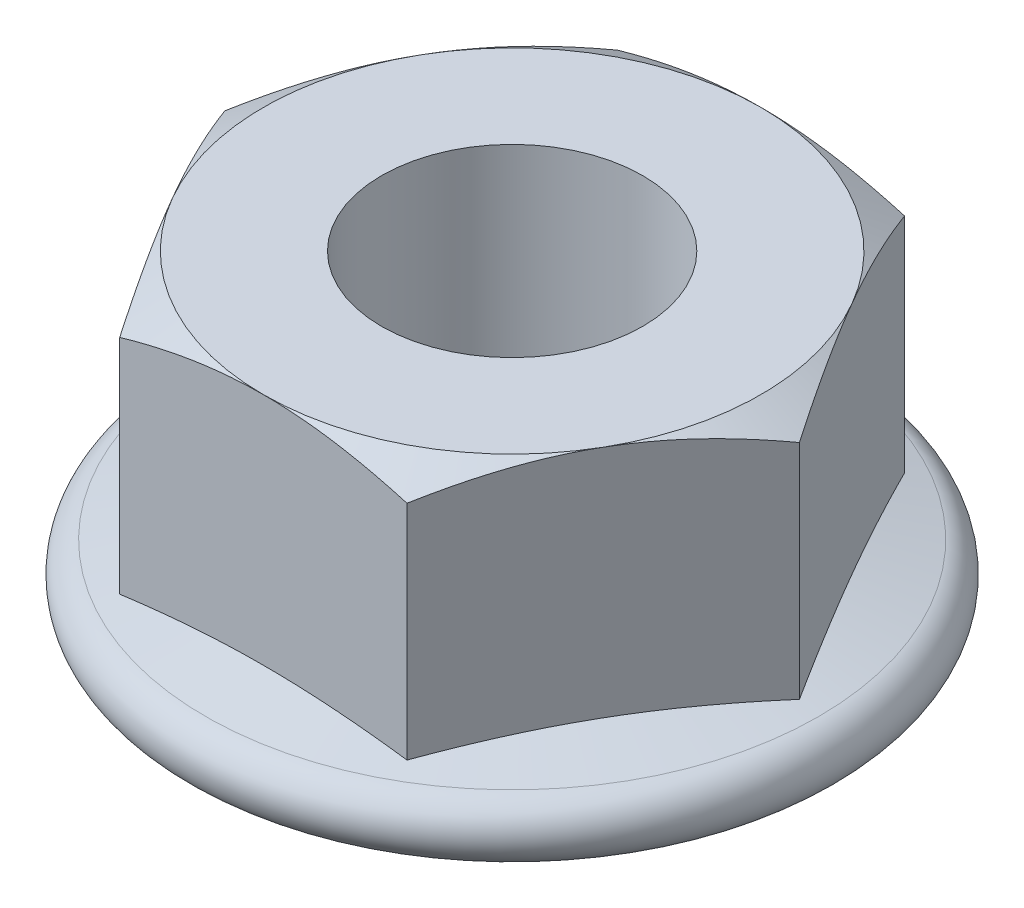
ISO-10303-21;
HEADER;
FILE_DESCRIPTION(('STEP AP214'),'2;1');
FILE_NAME('part.step','',(''),(''),'','','');
FILE_SCHEMA(('AUTOMOTIVE_DESIGN { 1 0 10303 214 1 1 1 1 }'));
ENDSEC;
DATA;
#1=APPLICATION_CONTEXT('core data for automotive mechanical design processes');
#2=APPLICATION_PROTOCOL_DEFINITION('international standard','automotive_design',2000,#1);
#3=PRODUCT_CONTEXT('',#1,'mechanical');
#4=PRODUCT('Part','Part','',(#3));
#5=PRODUCT_RELATED_PRODUCT_CATEGORY('part','',(#4));
#6=PRODUCT_DEFINITION_FORMATION('','',#4);
#7=PRODUCT_DEFINITION_CONTEXT('part definition',#1,'design');
#8=PRODUCT_DEFINITION('design','',#6,#7);
#9=PRODUCT_DEFINITION_SHAPE('','',#8);
#10=(LENGTH_UNIT() NAMED_UNIT(*) SI_UNIT(.MILLI.,.METRE.));
#11=(NAMED_UNIT(*) PLANE_ANGLE_UNIT() SI_UNIT($,.RADIAN.));
#12=(NAMED_UNIT(*) SI_UNIT($,.STERADIAN.) SOLID_ANGLE_UNIT());
#13=UNCERTAINTY_MEASURE_WITH_UNIT(LENGTH_MEASURE(1.E-05),#10,'distance_accuracy_value','');
#14=(GEOMETRIC_REPRESENTATION_CONTEXT(3) GLOBAL_UNCERTAINTY_ASSIGNED_CONTEXT((#13)) GLOBAL_UNIT_ASSIGNED_CONTEXT((#10,
#11,#12)) REPRESENTATION_CONTEXT('',''));
#15=CARTESIAN_POINT('',(0.,0.,0.));
#16=DIRECTION('',(0.,0.,1.));
#17=DIRECTION('',(1.,0.,0.));
#18=AXIS2_PLACEMENT_3D('',#15,#16,#17);
#19=CARTESIAN_POINT('',(-2.30940107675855,5.,-3.99999999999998));
#20=DIRECTION('',(0.866025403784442,0.,0.499999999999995));
#21=DIRECTION('',(0.499999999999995,0.,-0.866025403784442));
#22=AXIS2_PLACEMENT_3D('',#19,#20,#21);
#23=PLANE('',#22);
#24=DIRECTION('',(0.,-1.,0.));
#25=VECTOR('',#24,1.);
#26=CARTESIAN_POINT('',(-2.30940107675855,5.,-3.99999999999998));
#27=LINE('',#26,#25);
#28=CARTESIAN_POINT('',(-2.30940107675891,4.64273441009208,-3.99999999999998));
#29=VERTEX_POINT('',#28);
#30=CARTESIAN_POINT('',(-2.30940107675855,1.06618990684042,-3.99999999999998));
#31=VERTEX_POINT('',#30);
#32=EDGE_CURVE('E144',#29,#31,#27,.T.);
#33=ORIENTED_EDGE('',*,*,#32,.T.);
#34=CARTESIAN_POINT('',(-2.30928560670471,1.06615896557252,-4.00019999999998));
#35=CARTESIAN_POINT('',(-2.40519879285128,1.09187047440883,-3.83407348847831));
#36=CARTESIAN_POINT('',(-2.5012858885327,1.11521234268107,-3.66764575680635));
#37=CARTESIAN_POINT('',(-2.69379944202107,1.15622188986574,-3.33420250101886));
#38=CARTESIAN_POINT('',(-2.79022602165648,1.17388726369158,-3.16718676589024));
#39=CARTESIAN_POINT('',(-2.98283386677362,1.20251246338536,-2.83358019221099));
#40=CARTESIAN_POINT('',(-3.07901382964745,1.21350642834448,-2.66699160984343));
#41=CARTESIAN_POINT('',(-3.27149641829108,1.22824821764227,-2.33360198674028));
#42=CARTESIAN_POINT('',(-3.36779901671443,1.23199744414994,-2.16680099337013));
#43=CARTESIAN_POINT('',(-3.56040421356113,1.23199744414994,-1.83319900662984));
#44=CARTESIAN_POINT('',(-3.65670681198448,1.22824821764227,-1.6663980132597));
#45=CARTESIAN_POINT('',(-3.84918940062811,1.21350642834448,-1.33300839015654));
#46=CARTESIAN_POINT('',(-3.94536936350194,1.20251246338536,-1.16641980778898));
#47=CARTESIAN_POINT('',(-4.13797720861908,1.17388726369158,-0.832813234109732));
#48=CARTESIAN_POINT('',(-4.23440378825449,1.15622188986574,-0.665797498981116));
#49=CARTESIAN_POINT('',(-4.42691734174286,1.11521234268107,-0.332354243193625));
#50=CARTESIAN_POINT('',(-4.52300443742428,1.09187047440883,-0.165926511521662));
#51=CARTESIAN_POINT('',(-4.61891762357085,1.06615896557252,0.000199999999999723));
#52=B_SPLINE_CURVE_WITH_KNOTS('',3,(#34,#35,#36,#37,#38,#39,#40,#41,#42,#43,#44,#45,#46,#47,#48,
#49,#50,#51),.UNSPECIFIED.,.F.,.F.,(4,2,2,2,2,2,2,2,4),(0.,0.58065590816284,1.16154730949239,
1.73944052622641,2.31722188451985,2.8950032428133,3.47289645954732,4.05378786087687,
4.63444376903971),.UNSPECIFIED.);
#53=CARTESIAN_POINT('',(-4.61880215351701,1.06618990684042,0.));
#54=VERTEX_POINT('',#53);
#55=EDGE_CURVE('E67',#31,#54,#52,.T.);
#56=ORIENTED_EDGE('',*,*,#55,.T.);
#57=DIRECTION('',(0.,-1.,0.));
#58=VECTOR('',#57,1.);
#59=CARTESIAN_POINT('',(-4.61880215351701,5.,0.));
#60=LINE('',#59,#58);
#61=CARTESIAN_POINT('',(-4.61880215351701,4.64273441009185,0.));
#62=VERTEX_POINT('',#61);
#63=EDGE_CURVE('E157',#62,#54,#60,.T.);
#64=ORIENTED_EDGE('',*,*,#63,.F.);
#65=CARTESIAN_POINT('',(-4.61891762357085,4.64266774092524,0.0002));
#66=CARTESIAN_POINT('',(-4.51743148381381,4.70128212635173,-0.175579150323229));
#67=CARTESIAN_POINT('',(-4.41506932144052,4.75458967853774,-0.352875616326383));
#68=CARTESIAN_POINT('',(-4.2085725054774,4.8476383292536,-0.71053859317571));
#69=CARTESIAN_POINT('',(-4.10443418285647,4.8873465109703,-0.890911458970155));
#70=CARTESIAN_POINT('',(-3.89744813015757,4.94915778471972,-1.2494218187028));
#71=CARTESIAN_POINT('',(-3.7946322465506,4.97167226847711,-1.42750415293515));
#72=CARTESIAN_POINT('',(-3.58851671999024,4.99854937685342,-1.78450671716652));
#73=CARTESIAN_POINT('',(-3.48521782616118,5.00293425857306,-1.96342564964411));
#74=CARTESIAN_POINT('',(-3.2921997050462,4.99380992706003,-2.29774284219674));
#75=CARTESIAN_POINT('',(-3.20245157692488,4.98254104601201,-2.45319115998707));
#76=CARTESIAN_POINT('',(-3.02354002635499,4.94682600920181,-2.76307505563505));
#77=CARTESIAN_POINT('',(-2.93437722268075,4.92236765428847,-2.91750956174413));
#78=CARTESIAN_POINT('',(-2.75509682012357,4.86122393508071,-3.22803232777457));
#79=CARTESIAN_POINT('',(-2.66500191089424,4.82427939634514,-3.38408128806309));
#80=CARTESIAN_POINT('',(-2.48615580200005,4.74042992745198,-3.69385183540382));
#81=CARTESIAN_POINT('',(-2.39740231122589,4.69354469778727,-3.84757739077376));
#82=CARTESIAN_POINT('',(-2.30928560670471,4.64266774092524,-4.00019999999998));
#83=B_SPLINE_CURVE_WITH_KNOTS('',3,(#65,#66,#67,#68,#69,#70,#71,#72,#73,#74,#75,#76,#77,#78,#79,
#80,#81,#82),.UNSPECIFIED.,.F.,.F.,(4,2,2,2,2,2,2,2,4),(0.,0.634047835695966,1.26961969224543,
1.88946157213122,2.50854226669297,3.04757825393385,3.58711366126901,4.1386165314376,
4.68903648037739),.UNSPECIFIED.);
#84=CARTESIAN_POINT('',(-3.46410161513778,5.,-1.99999999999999));
#85=VERTEX_POINT('',#84);
#86=EDGE_CURVE('E267',#62,#85,#83,.T.);
#87=ORIENTED_EDGE('',*,*,#86,.T.);
#88=EDGE_CURVE('E177',#85,#29,#83,.T.);
#89=ORIENTED_EDGE('',*,*,#88,.T.);
#90=EDGE_LOOP('',(#33,#56,#64,#87,#89));
#91=FACE_BOUND('',#90,.T.);
#92=ADVANCED_FACE('F47',(#91),#23,.F.);
#93=CARTESIAN_POINT('',(-4.61880215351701,5.,0.));
#94=DIRECTION('',(0.866025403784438,0.,-0.500000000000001));
#95=DIRECTION('',(-0.500000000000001,0.,-0.866025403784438));
#96=AXIS2_PLACEMENT_3D('',#93,#94,#95);
#97=PLANE('',#96);
#98=ORIENTED_EDGE('',*,*,#63,.T.);
#99=CARTESIAN_POINT('',(-4.61891762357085,1.06615896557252,-0.000200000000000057));
#100=CARTESIAN_POINT('',(-4.52300443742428,1.09187047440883,0.165926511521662));
#101=CARTESIAN_POINT('',(-4.42691734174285,1.11521234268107,0.332354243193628));
#102=CARTESIAN_POINT('',(-4.23440378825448,1.15622188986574,0.665797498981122));
#103=CARTESIAN_POINT('',(-4.13797720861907,1.17388726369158,0.832813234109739));
#104=CARTESIAN_POINT('',(-3.94536936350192,1.20251246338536,1.16641980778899));
#105=CARTESIAN_POINT('',(-3.84918940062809,1.21350642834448,1.33300839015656));
#106=CARTESIAN_POINT('',(-3.65670681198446,1.22824821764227,1.66639801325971));
#107=CARTESIAN_POINT('',(-3.5604042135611,1.23199744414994,1.83319900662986));
#108=CARTESIAN_POINT('',(-3.3677990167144,1.23199744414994,2.16680099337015));
#109=CARTESIAN_POINT('',(-3.27149641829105,1.22824821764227,2.3336019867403));
#110=CARTESIAN_POINT('',(-3.07901382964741,1.21350642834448,2.66699160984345));
#111=CARTESIAN_POINT('',(-2.98283386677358,1.20251246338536,2.83358019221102));
#112=CARTESIAN_POINT('',(-2.79022602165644,1.17388726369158,3.16718676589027));
#113=CARTESIAN_POINT('',(-2.69379944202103,1.15622188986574,3.33420250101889));
#114=CARTESIAN_POINT('',(-2.50128588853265,1.11521234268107,3.66764575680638));
#115=CARTESIAN_POINT('',(-2.40519879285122,1.09187047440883,3.83407348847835));
#116=CARTESIAN_POINT('',(-2.30928560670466,1.06615896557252,4.00020000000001));
#117=B_SPLINE_CURVE_WITH_KNOTS('',3,(#99,#100,#101,#102,#103,#104,#105,#106,#107,#108,#109,#110,
#111,#112,#113,#114,#115,#116),.UNSPECIFIED.,.F.,.F.,(4,2,2,2,2,2,2,2,4),(0.,0.580655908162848,
1.1615473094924,1.73944052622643,2.31722188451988,2.89500324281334,3.47289645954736,
4.05378786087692,4.63444376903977),.UNSPECIFIED.);
#118=CARTESIAN_POINT('',(-2.3094010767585,1.06618990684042,4.00000000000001));
#119=VERTEX_POINT('',#118);
#120=EDGE_CURVE('E243',#54,#119,#117,.T.);
#121=ORIENTED_EDGE('',*,*,#120,.T.);
#122=DIRECTION('',(0.,-1.,0.));
#123=VECTOR('',#122,1.);
#124=CARTESIAN_POINT('',(-2.3094010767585,5.,4.00000000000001));
#125=LINE('',#124,#123);
#126=CARTESIAN_POINT('',(-2.3094010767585,4.64273441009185,4.00000000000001));
#127=VERTEX_POINT('',#126);
#128=EDGE_CURVE('E154',#127,#119,#125,.T.);
#129=ORIENTED_EDGE('',*,*,#128,.F.);
#130=CARTESIAN_POINT('',(-2.30928560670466,4.64266774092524,4.00020000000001));
#131=CARTESIAN_POINT('',(-2.4107717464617,4.70128212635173,3.82442084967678));
#132=CARTESIAN_POINT('',(-2.51313390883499,4.75458967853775,3.64712438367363));
#133=CARTESIAN_POINT('',(-2.71963072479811,4.84763832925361,3.2894614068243));
#134=CARTESIAN_POINT('',(-2.82376904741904,4.88734651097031,3.10908854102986));
#135=CARTESIAN_POINT('',(-3.03075510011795,4.94915778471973,2.75057818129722));
#136=CARTESIAN_POINT('',(-3.13357098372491,4.97167226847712,2.57249584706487));
#137=CARTESIAN_POINT('',(-3.33968651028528,4.99854937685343,2.2154932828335));
#138=CARTESIAN_POINT('',(-3.44298540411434,5.00293425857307,2.03657435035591));
#139=CARTESIAN_POINT('',(-3.63600352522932,4.99380992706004,1.70225715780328));
#140=CARTESIAN_POINT('',(-3.72575165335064,4.98254104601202,1.54680884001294));
#141=CARTESIAN_POINT('',(-3.90466320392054,4.94682600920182,1.23692494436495));
#142=CARTESIAN_POINT('',(-3.99382600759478,4.92236765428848,1.08249043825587));
#143=CARTESIAN_POINT('',(-4.17310641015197,4.86122393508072,0.771967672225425));
#144=CARTESIAN_POINT('',(-4.26320131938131,4.82427939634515,0.6159187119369));
#145=CARTESIAN_POINT('',(-4.44204742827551,4.74042992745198,0.306148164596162));
#146=CARTESIAN_POINT('',(-4.53080091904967,4.69354469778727,0.152422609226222));
#147=CARTESIAN_POINT('',(-4.61891762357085,4.64266774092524,-0.000199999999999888));
#148=B_SPLINE_CURVE_WITH_KNOTS('',3,(#130,#131,#132,#133,#134,#135,#136,#137,#138,#139,#140,
#141,#142,#143,#144,#145,#146,#147),.UNSPECIFIED.,.F.,.F.,(4,2,2,2,2,2,2,2,4),(0.,
0.634047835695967,1.26961969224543,1.88946157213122,2.50854226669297,3.04757825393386,
3.58711366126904,4.13861653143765,4.68903648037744),.UNSPECIFIED.);
#149=CARTESIAN_POINT('',(-3.46410161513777,5.,2.00000000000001));
#150=VERTEX_POINT('',#149);
#151=EDGE_CURVE('E229',#127,#150,#148,.T.);
#152=ORIENTED_EDGE('',*,*,#151,.T.);
#153=EDGE_CURVE('E74',#150,#62,#148,.T.);
#154=ORIENTED_EDGE('',*,*,#153,.T.);
#155=EDGE_LOOP('',(#98,#121,#129,#152,#154));
#156=FACE_BOUND('',#155,.T.);
#157=ADVANCED_FACE('F235',(#156),#97,.F.);
#158=CARTESIAN_POINT('',(-2.3094010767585,5.,4.00000000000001));
#159=DIRECTION('',(0.,0.,-1.));
#160=DIRECTION('',(-1.,0.,0.));
#161=AXIS2_PLACEMENT_3D('',#158,#159,#160);
#162=PLANE('',#161);
#163=ORIENTED_EDGE('',*,*,#128,.T.);
#164=CARTESIAN_POINT('',(-6.03476553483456,0.363827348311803,4.00000000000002));
#165=CARTESIAN_POINT('',(-5.85407609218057,0.404171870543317,4.00000000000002));
#166=CARTESIAN_POINT('',(-5.673271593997,0.444010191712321,4.00000000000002));
#167=CARTESIAN_POINT('',(-5.31137593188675,0.522401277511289,4.00000000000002));
#168=CARTESIAN_POINT('',(-5.13028475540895,0.560953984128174,4.00000000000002));
#169=CARTESIAN_POINT('',(-4.76758903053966,0.636535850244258,4.00000000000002));
#170=CARTESIAN_POINT('',(-4.58598414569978,0.673563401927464,4.00000000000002));
#171=CARTESIAN_POINT('',(-4.22239138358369,0.745683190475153,4.00000000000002));
#172=CARTESIAN_POINT('',(-4.0404035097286,0.78077544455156,4.00000000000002));
#173=CARTESIAN_POINT('',(-3.67756637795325,0.848270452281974,4.00000000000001));
#174=CARTESIAN_POINT('',(-3.49672102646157,0.880693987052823,4.00000000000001));
#175=CARTESIAN_POINT('',(-3.13453308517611,0.942626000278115,4.00000000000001));
#176=CARTESIAN_POINT('',(-2.95319048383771,0.972134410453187,4.00000000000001));
#177=CARTESIAN_POINT('',(-2.40837575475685,1.05528338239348,4.00000000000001));
#178=CARTESIAN_POINT('',(-2.04402877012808,1.10356467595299,4.00000000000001));
#179=CARTESIAN_POINT('',(-1.49381690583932,1.16060333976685,4.00000000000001));
#180=CARTESIAN_POINT('',(-1.30875134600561,1.17710064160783,4.00000000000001));
#181=CARTESIAN_POINT('',(-0.93816839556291,1.20395013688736,4.));
#182=CARTESIAN_POINT('',(-0.752651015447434,1.21430247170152,4.));
#183=CARTESIAN_POINT('',(-0.381439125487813,1.22826045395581,4.));
#184=CARTESIAN_POINT('',(-0.195744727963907,1.23186903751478,4.));
#185=CARTESIAN_POINT('',(0.175649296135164,1.23211908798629,4.));
#186=CARTESIAN_POINT('',(0.361348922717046,1.22876054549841,4.));
#187=CARTESIAN_POINT('',(0.733261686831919,1.21526181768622,4.));
#188=CARTESIAN_POINT('',(0.919473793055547,1.20509378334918,4.));
#189=CARTESIAN_POINT('',(1.29145662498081,1.17854518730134,4.));
#190=CARTESIAN_POINT('',(1.47722732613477,1.16216428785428,4.));
#191=CARTESIAN_POINT('',(1.84832327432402,1.12399907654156,3.99999999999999));
#192=CARTESIAN_POINT('',(2.0336481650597,1.10221135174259,3.99999999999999));
#193=CARTESIAN_POINT('',(2.40370351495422,1.05411656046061,3.99999999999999));
#194=CARTESIAN_POINT('',(2.58843397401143,1.02780949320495,3.99999999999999));
#195=CARTESIAN_POINT('',(2.96427074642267,0.970436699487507,3.99999999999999));
#196=CARTESIAN_POINT('',(3.15535521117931,0.939229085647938,3.99999999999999));
#197=CARTESIAN_POINT('',(3.5369765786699,0.873618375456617,3.99999999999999));
#198=CARTESIAN_POINT('',(3.7275134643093,0.839215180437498,3.99999999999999));
#199=CARTESIAN_POINT('',(4.10812964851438,0.767853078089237,3.99999999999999));
#200=CARTESIAN_POINT('',(4.2982088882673,0.730893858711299,3.99999999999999));
#201=CARTESIAN_POINT('',(4.67795907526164,0.654929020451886,3.99999999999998));
#202=CARTESIAN_POINT('',(4.86763001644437,0.615923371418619,3.99999999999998));
#203=CARTESIAN_POINT('',(5.43623354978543,0.496438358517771,3.99999999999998));
#204=CARTESIAN_POINT('',(5.81465099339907,0.413511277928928,3.99999999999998));
#205=CARTESIAN_POINT('',(6.57052039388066,0.243371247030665,3.99999999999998));
#206=CARTESIAN_POINT('',(6.94797232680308,0.156158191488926,3.99999999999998));
#207=CARTESIAN_POINT('',(7.69749895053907,-0.0201097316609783,3.99999999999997));
#208=CARTESIAN_POINT('',(8.06958220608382,-0.109128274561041,3.99999999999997));
#209=CARTESIAN_POINT('',(8.81326242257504,-0.289205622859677,3.99999999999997));
#210=CARTESIAN_POINT('',(9.18485937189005,-0.380264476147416,3.99999999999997));
#211=CARTESIAN_POINT('',(9.92715728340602,-0.563736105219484,3.99999999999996));
#212=CARTESIAN_POINT('',(10.2978587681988,-0.656146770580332,3.99999999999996));
#213=CARTESIAN_POINT('',(11.0389641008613,-0.842097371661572,3.99999999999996));
#214=CARTESIAN_POINT('',(11.4093679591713,-0.935637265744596,3.99999999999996));
#215=CARTESIAN_POINT('',(11.779671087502,-1.02956967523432,3.99999999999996));
#216=B_SPLINE_CURVE_WITH_KNOTS('',3,(#164,#165,#166,#167,#168,#169,#170,#171,#172,#173,#174,
#175,#176,#177,#178,#179,#180,#181,#182,#183,#184,#185,#186,#187,#188,#189,#190,#191,#192,#193,
#194,#195,#196,#197,#198,#199,#200,#201,#202,#203,#204,#205,#206,#207,#208,#209,#210,#211,#212,
#213,#214,#215),.UNSPECIFIED.,.F.,.F.,(4,2,2,2,2,2,2,2,2,2,2,2,2,2,2,2,2,2,2,2,2,2,2,2,2,4),(0.,
0.555418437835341,1.11086190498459,1.66687666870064,2.22288648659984,2.77404869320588,
3.32522380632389,4.42730547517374,4.98462078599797,5.54192327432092,6.09898306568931,
6.65604360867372,7.21539640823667,7.77477961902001,8.33451682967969,8.894254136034,
9.47506851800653,10.0559008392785,10.6368041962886,11.2177161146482,12.3798632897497,
13.5420390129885,14.6897816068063,15.8375511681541,16.9836878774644,18.1297824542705),.UNSPECIFIED.);
#217=CARTESIAN_POINT('',(2.30940107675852,1.06618990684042,3.99999999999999));
#218=VERTEX_POINT('',#217);
#219=EDGE_CURVE('E249',#119,#218,#216,.T.);
#220=ORIENTED_EDGE('',*,*,#219,.T.);
#221=DIRECTION('',(0.,-1.,0.));
#222=VECTOR('',#221,1.);
#223=CARTESIAN_POINT('',(2.30940107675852,5.,3.99999999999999));
#224=LINE('',#223,#222);
#225=CARTESIAN_POINT('',(2.30940107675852,4.64273441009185,3.99999999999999));
#226=VERTEX_POINT('',#225);
#227=EDGE_CURVE('E146',#226,#218,#224,.T.);
#228=ORIENTED_EDGE('',*,*,#227,.F.);
#229=CARTESIAN_POINT('',(-6.24956479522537,3.02543639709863,4.00000000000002));
#230=CARTESIAN_POINT('',(-6.07439776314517,3.11059300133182,4.00000000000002));
#231=CARTESIAN_POINT('',(-5.8988334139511,3.1949460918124,4.00000000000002));
#232=CARTESIAN_POINT('',(-5.54669883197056,3.36159400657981,4.00000000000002));
#233=CARTESIAN_POINT('',(-5.37012844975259,3.4438885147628,4.00000000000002));
#234=CARTESIAN_POINT('',(-5.01488365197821,3.60637180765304,4.00000000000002));
#235=CARTESIAN_POINT('',(-4.83620304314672,3.68654709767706,4.00000000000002));
#236=CARTESIAN_POINT('',(-4.47743595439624,3.84367571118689,4.00000000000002));
#237=CARTESIAN_POINT('',(-4.29734954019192,3.9206291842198,4.00000000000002));
#238=CARTESIAN_POINT('',(-3.92963704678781,4.07288577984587,4.00000000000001));
#239=CARTESIAN_POINT('',(-3.74195533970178,4.14805527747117,4.00000000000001));
#240=CARTESIAN_POINT('',(-3.36441371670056,4.29281623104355,4.00000000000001));
#241=CARTESIAN_POINT('',(-3.17455356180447,4.36240706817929,4.00000000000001));
#242=CARTESIAN_POINT('',(-2.79269293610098,4.49421868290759,4.00000000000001));
#243=CARTESIAN_POINT('',(-2.60069751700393,4.55645395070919,4.00000000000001));
#244=CARTESIAN_POINT('',(-2.2139536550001,4.6715886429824,4.00000000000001));
#245=CARTESIAN_POINT('',(-2.01920608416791,4.72449095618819,4.00000000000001));
#246=CARTESIAN_POINT('',(-1.62786659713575,4.81818610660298,4.00000000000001));
#247=CARTESIAN_POINT('',(-1.43129008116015,4.85904209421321,4.00000000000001));
#248=CARTESIAN_POINT('',(-1.03564620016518,4.92634254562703,4.));
#249=CARTESIAN_POINT('',(-0.836579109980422,4.95278858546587,4.));
#250=CARTESIAN_POINT('',(-0.439564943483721,4.9888158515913,4.));
#251=CARTESIAN_POINT('',(-0.241638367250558,4.99861740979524,4.));
#252=CARTESIAN_POINT('',(0.154344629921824,5.00110762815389,4.));
#253=CARTESIAN_POINT('',(0.35240105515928,4.99379568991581,4.));
#254=CARTESIAN_POINT('',(0.687171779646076,4.96749417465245,4.));
#255=CARTESIAN_POINT('',(0.824239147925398,4.95272797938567,4.));
#256=CARTESIAN_POINT('',(1.09739552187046,4.91589242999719,4.));
#257=CARTESIAN_POINT('',(1.23348439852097,4.89382213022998,4.));
#258=CARTESIAN_POINT('',(1.64007695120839,4.81781302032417,3.99999999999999));
#259=CARTESIAN_POINT('',(1.90877289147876,4.75408791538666,3.99999999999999));
#260=CARTESIAN_POINT('',(2.31083189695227,4.64321679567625,3.99999999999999));
#261=CARTESIAN_POINT('',(2.446265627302,4.60314998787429,3.99999999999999));
#262=CARTESIAN_POINT('',(2.71581704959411,4.51877130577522,3.99999999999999));
#263=CARTESIAN_POINT('',(2.84993473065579,4.47445939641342,3.99999999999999));
#264=CARTESIAN_POINT('',(3.11689937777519,4.3823087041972,3.99999999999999));
#265=CARTESIAN_POINT('',(3.24974669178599,4.3344709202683,3.99999999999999));
#266=CARTESIAN_POINT('',(3.51433113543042,4.23583971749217,3.99999999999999));
#267=CARTESIAN_POINT('',(3.64606829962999,4.18504639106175,3.99999999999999));
#268=CARTESIAN_POINT('',(4.03552967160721,4.03067602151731,3.99999999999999));
#269=CARTESIAN_POINT('',(4.29185379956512,3.92356878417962,3.99999999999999));
#270=CARTESIAN_POINT('',(4.80158693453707,3.70260238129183,3.99999999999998));
#271=CARTESIAN_POINT('',(5.05499549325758,3.58874219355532,3.99999999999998));
#272=CARTESIAN_POINT('',(5.5596669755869,3.35605493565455,3.99999999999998));
#273=CARTESIAN_POINT('',(5.81092876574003,3.23722541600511,3.99999999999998));
#274=CARTESIAN_POINT('',(6.31167275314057,2.99592495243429,3.99999999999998));
#275=CARTESIAN_POINT('',(6.56115505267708,2.87345421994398,3.99999999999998));
#276=CARTESIAN_POINT('',(7.05921282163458,2.62550837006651,3.99999999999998));
#277=CARTESIAN_POINT('',(7.30778565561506,2.50002797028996,3.99999999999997));
#278=CARTESIAN_POINT('',(7.80383301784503,2.24691149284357,3.99999999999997));
#279=CARTESIAN_POINT('',(8.05130753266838,2.11927538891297,3.99999999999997));
#280=CARTESIAN_POINT('',(8.79227811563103,1.7339250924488,3.99999999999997));
#281=CARTESIAN_POINT('',(9.28446560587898,1.47369630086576,3.99999999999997));
#282=CARTESIAN_POINT('',(10.2065127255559,0.980983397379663,3.99999999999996));
#283=CARTESIAN_POINT('',(10.6366385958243,0.748995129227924,3.99999999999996));
#284=CARTESIAN_POINT('',(11.4956202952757,0.282596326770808,3.99999999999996));
#285=CARTESIAN_POINT('',(11.9244760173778,0.0481855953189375,3.99999999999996));
#286=CARTESIAN_POINT('',(12.779620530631,-0.421519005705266,3.99999999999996));
#287=CARTESIAN_POINT('',(13.2059129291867,-0.656806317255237,3.99999999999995));
#288=CARTESIAN_POINT('',(14.0577080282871,-1.1287103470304,3.99999999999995));
#289=CARTESIAN_POINT('',(14.4832108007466,-1.36532693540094,3.99999999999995));
#290=CARTESIAN_POINT('',(14.9084455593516,-1.60242157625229,3.99999999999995));
#291=B_SPLINE_CURVE_WITH_KNOTS('',3,(#229,#230,#231,#232,#233,#234,#235,#236,#237,#238,#239,
#240,#241,#242,#243,#244,#245,#246,#247,#248,#249,#250,#251,#252,#253,#254,#255,#256,#257,#258,
#259,#260,#261,#262,#263,#264,#265,#266,#267,#268,#269,#270,#271,#272,#273,#274,#275,#276,#277,
#278,#279,#280,#281,#282,#283,#284,#285,#286,#287,#288,#289,#290),.UNSPECIFIED.,.F.,.F.,(4,2,2,
2,2,2,2,2,2,2,2,2,2,2,2,2,2,2,2,2,2,2,2,2,2,2,2,2,2,2,4),(0.,0.584315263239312,1.16871970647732,
1.75622594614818,2.3437048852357,2.95016239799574,3.55668708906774,4.16199629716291,
4.76711782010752,5.36900829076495,5.97083291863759,6.56462691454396,7.1584416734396,
7.57182368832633,7.98525924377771,8.8125310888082,9.23620216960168,9.65987675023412,
10.0834317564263,10.5069735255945,11.3402234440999,12.1735998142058,13.0073919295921,
13.8411357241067,14.6764689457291,15.5118123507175,17.1820143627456,18.6481042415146,
20.1143143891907,21.5750541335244,23.0356535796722),.UNSPECIFIED.);
#292=CARTESIAN_POINT('',(0.,5.,4.00000000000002));
#293=VERTEX_POINT('',#292);
#294=EDGE_CURVE('E148',#226,#293,#291,.F.);
#295=ORIENTED_EDGE('',*,*,#294,.T.);
#296=EDGE_CURVE('E230',#293,#127,#291,.F.);
#297=ORIENTED_EDGE('',*,*,#296,.T.);
#298=EDGE_LOOP('',(#163,#220,#228,#295,#297));
#299=FACE_BOUND('',#298,.T.);
#300=ADVANCED_FACE('F238',(#299),#162,.F.);
#301=CARTESIAN_POINT('',(2.30940107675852,5.,3.99999999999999));
#302=DIRECTION('',(-0.866025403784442,0.,-0.499999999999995));
#303=DIRECTION('',(-0.499999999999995,0.,0.866025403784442));
#304=AXIS2_PLACEMENT_3D('',#301,#302,#303);
#305=PLANE('',#304);
#306=ORIENTED_EDGE('',*,*,#227,.T.);
#307=CARTESIAN_POINT('',(2.30928560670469,1.06615896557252,4.00019999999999));
#308=CARTESIAN_POINT('',(2.40519879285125,1.09187047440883,3.83407348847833));
#309=CARTESIAN_POINT('',(2.50128588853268,1.11521234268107,3.66764575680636));
#310=CARTESIAN_POINT('',(2.69379944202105,1.15622188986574,3.33420250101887));
#311=CARTESIAN_POINT('',(2.79022602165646,1.17388726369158,3.16718676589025));
#312=CARTESIAN_POINT('',(2.9828338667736,1.20251246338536,2.833580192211));
#313=CARTESIAN_POINT('',(3.07901382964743,1.21350642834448,2.66699160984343));
#314=CARTESIAN_POINT('',(3.27149641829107,1.22824821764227,2.33360198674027));
#315=CARTESIAN_POINT('',(3.36779901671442,1.23199744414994,2.16680099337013));
#316=CARTESIAN_POINT('',(3.56040421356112,1.23199744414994,1.83319900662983));
#317=CARTESIAN_POINT('',(3.65670681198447,1.22824821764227,1.66639801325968));
#318=CARTESIAN_POINT('',(3.8491894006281,1.21350642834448,1.33300839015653));
#319=CARTESIAN_POINT('',(3.94536936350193,1.20251246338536,1.16641980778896));
#320=CARTESIAN_POINT('',(4.13797720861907,1.17388726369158,0.832813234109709));
#321=CARTESIAN_POINT('',(4.23440378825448,1.15622188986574,0.665797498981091));
#322=CARTESIAN_POINT('',(4.42691734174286,1.11521234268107,0.332354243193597));
#323=CARTESIAN_POINT('',(4.52300443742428,1.09187047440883,0.165926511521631));
#324=CARTESIAN_POINT('',(4.61891762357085,1.06615896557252,-0.000200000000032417));
#325=B_SPLINE_CURVE_WITH_KNOTS('',3,(#307,#308,#309,#310,#311,#312,#313,#314,#315,#316,#317,
#318,#319,#320,#321,#322,#323,#324),.UNSPECIFIED.,.F.,.F.,(4,2,2,2,2,2,2,2,4),(0.,
0.580655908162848,1.1615473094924,1.73944052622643,2.31722188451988,2.89500324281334,
3.47289645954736,4.05378786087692,4.63444376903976),.UNSPECIFIED.);
#326=CARTESIAN_POINT('',(4.61880215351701,1.06618990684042,0.));
#327=VERTEX_POINT('',#326);
#328=EDGE_CURVE('E137',#218,#327,#325,.T.);
#329=ORIENTED_EDGE('',*,*,#328,.T.);
#330=DIRECTION('',(0.,-1.,0.));
#331=VECTOR('',#330,1.);
#332=CARTESIAN_POINT('',(4.61880215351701,5.,0.));
#333=LINE('',#332,#331);
#334=CARTESIAN_POINT('',(4.61880215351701,4.64273441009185,0.));
#335=VERTEX_POINT('',#334);
#336=EDGE_CURVE('E136',#335,#327,#333,.T.);
#337=ORIENTED_EDGE('',*,*,#336,.F.);
#338=CARTESIAN_POINT('',(4.61891762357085,4.64266774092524,-0.000200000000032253));
#339=CARTESIAN_POINT('',(4.51743148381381,4.70128212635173,0.175579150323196));
#340=CARTESIAN_POINT('',(4.41506932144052,4.75458967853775,0.35287561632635));
#341=CARTESIAN_POINT('',(4.2085725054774,4.84763832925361,0.710538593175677));
#342=CARTESIAN_POINT('',(4.10443418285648,4.88734651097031,0.890911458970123));
#343=CARTESIAN_POINT('',(3.89744813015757,4.94915778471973,1.24942181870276));
#344=CARTESIAN_POINT('',(3.7946322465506,4.97167226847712,1.42750415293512));
#345=CARTESIAN_POINT('',(3.58851671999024,4.99854937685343,1.78450671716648));
#346=CARTESIAN_POINT('',(3.48521782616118,5.00293425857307,1.96342564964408));
#347=CARTESIAN_POINT('',(3.2921997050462,4.99380992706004,2.29774284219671));
#348=CARTESIAN_POINT('',(3.20245157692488,4.98254104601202,2.45319115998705));
#349=CARTESIAN_POINT('',(3.02354002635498,4.94682600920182,2.76307505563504));
#350=CARTESIAN_POINT('',(2.93437722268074,4.92236765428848,2.91750956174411));
#351=CARTESIAN_POINT('',(2.75509682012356,4.86122393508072,3.22803232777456));
#352=CARTESIAN_POINT('',(2.66500191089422,4.82427939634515,3.38408128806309));
#353=CARTESIAN_POINT('',(2.48615580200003,4.74042992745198,3.69385183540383));
#354=CARTESIAN_POINT('',(2.39740231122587,4.69354469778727,3.84757739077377));
#355=CARTESIAN_POINT('',(2.30928560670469,4.64266774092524,4.00019999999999));
#356=B_SPLINE_CURVE_WITH_KNOTS('',3,(#338,#339,#340,#341,#342,#343,#344,#345,#346,#347,#348,
#349,#350,#351,#352,#353,#354,#355),.UNSPECIFIED.,.F.,.F.,(4,2,2,2,2,2,2,2,4),(0.,
0.634047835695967,1.26961969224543,1.88946157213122,2.50854226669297,3.04757825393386,
3.58711366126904,4.13861653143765,4.68903648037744),.UNSPECIFIED.);
#357=CARTESIAN_POINT('',(3.46410161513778,5.,1.99999999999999));
#358=VERTEX_POINT('',#357);
#359=EDGE_CURVE('E220',#335,#358,#356,.T.);
#360=ORIENTED_EDGE('',*,*,#359,.T.);
#361=EDGE_CURVE('E262',#358,#226,#356,.T.);
#362=ORIENTED_EDGE('',*,*,#361,.T.);
#363=EDGE_LOOP('',(#306,#329,#337,#360,#362));
#364=FACE_BOUND('',#363,.T.);
#365=ADVANCED_FACE('F290',(#364),#305,.F.);
#366=CARTESIAN_POINT('',(4.61880215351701,5.,0.));
#367=DIRECTION('',(-0.866025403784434,0.,0.500000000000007));
#368=DIRECTION('',(0.500000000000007,0.,0.866025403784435));
#369=AXIS2_PLACEMENT_3D('',#366,#367,#368);
#370=PLANE('',#369);
#371=ORIENTED_EDGE('',*,*,#336,.T.);
#372=CARTESIAN_POINT('',(4.61891762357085,1.06615896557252,0.000199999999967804));
#373=CARTESIAN_POINT('',(4.52300443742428,1.09187047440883,-0.165926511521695));
#374=CARTESIAN_POINT('',(4.42691734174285,1.11521234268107,-0.332354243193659));
#375=CARTESIAN_POINT('',(4.23440378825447,1.15622188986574,-0.665797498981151));
#376=CARTESIAN_POINT('',(4.13797720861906,1.17388726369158,-0.832813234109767));
#377=CARTESIAN_POINT('',(3.94536936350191,1.20251246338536,-1.16641980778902));
#378=CARTESIAN_POINT('',(3.84918940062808,1.21350642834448,-1.33300839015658));
#379=CARTESIAN_POINT('',(3.65670681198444,1.22824821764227,-1.66639801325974));
#380=CARTESIAN_POINT('',(3.56040421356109,1.23199744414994,-1.83319900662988));
#381=CARTESIAN_POINT('',(3.36779901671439,1.23199744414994,-2.16680099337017));
#382=CARTESIAN_POINT('',(3.27149641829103,1.22824821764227,-2.33360198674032));
#383=CARTESIAN_POINT('',(3.0790138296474,1.21350642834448,-2.66699160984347));
#384=CARTESIAN_POINT('',(2.98283386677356,1.20251246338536,-2.83358019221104));
#385=CARTESIAN_POINT('',(2.79022602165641,1.17388726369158,-3.16718676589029));
#386=CARTESIAN_POINT('',(2.693799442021,1.15622188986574,-3.33420250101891));
#387=CARTESIAN_POINT('',(2.50128588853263,1.11521234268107,-3.6676457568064));
#388=CARTESIAN_POINT('',(2.4051987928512,1.09187047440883,-3.83407348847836));
#389=CARTESIAN_POINT('',(2.30928560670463,1.06615896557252,-4.00020000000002));
#390=B_SPLINE_CURVE_WITH_KNOTS('',3,(#372,#373,#374,#375,#376,#377,#378,#379,#380,#381,#382,
#383,#384,#385,#386,#387,#388,#389),.UNSPECIFIED.,.F.,.F.,(4,2,2,2,2,2,2,2,4),(0.,
0.580655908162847,1.1615473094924,1.73944052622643,2.31722188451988,2.89500324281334,
3.47289645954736,4.05378786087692,4.63444376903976),.UNSPECIFIED.);
#391=CARTESIAN_POINT('',(2.30940107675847,1.06618990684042,-4.00000000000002));
#392=VERTEX_POINT('',#391);
#393=EDGE_CURVE('E122',#327,#392,#390,.T.);
#394=ORIENTED_EDGE('',*,*,#393,.T.);
#395=DIRECTION('',(0.,-1.,0.));
#396=VECTOR('',#395,1.);
#397=CARTESIAN_POINT('',(2.30940107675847,5.,-4.00000000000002));
#398=LINE('',#397,#396);
#399=CARTESIAN_POINT('',(2.30940107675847,4.64273441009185,-4.00000000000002));
#400=VERTEX_POINT('',#399);
#401=EDGE_CURVE('E133',#400,#392,#398,.T.);
#402=ORIENTED_EDGE('',*,*,#401,.F.);
#403=CARTESIAN_POINT('',(2.30928560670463,4.64266774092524,-4.00020000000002));
#404=CARTESIAN_POINT('',(2.41077174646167,4.70128212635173,-3.8244208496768));
#405=CARTESIAN_POINT('',(2.51313390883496,4.75458967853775,-3.64712438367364));
#406=CARTESIAN_POINT('',(2.71963072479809,4.84763832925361,-3.28946140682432));
#407=CARTESIAN_POINT('',(2.82376904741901,4.88734651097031,-3.10908854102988));
#408=CARTESIAN_POINT('',(3.03075510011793,4.94915778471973,-2.75057818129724));
#409=CARTESIAN_POINT('',(3.13357098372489,4.97167226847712,-2.57249584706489));
#410=CARTESIAN_POINT('',(3.33968651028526,4.99854937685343,-2.21549328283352));
#411=CARTESIAN_POINT('',(3.44298540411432,5.00293425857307,-2.03657435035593));
#412=CARTESIAN_POINT('',(3.63600352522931,4.99380992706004,-1.7022571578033));
#413=CARTESIAN_POINT('',(3.72575165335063,4.98254104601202,-1.54680884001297));
#414=CARTESIAN_POINT('',(3.90466320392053,4.94682600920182,-1.23692494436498));
#415=CARTESIAN_POINT('',(3.99382600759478,4.92236765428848,-1.0824904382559));
#416=CARTESIAN_POINT('',(4.17310641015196,4.86122393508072,-0.771967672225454));
#417=CARTESIAN_POINT('',(4.26320131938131,4.82427939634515,-0.61591871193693));
#418=CARTESIAN_POINT('',(4.4420474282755,4.74042992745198,-0.306148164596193));
#419=CARTESIAN_POINT('',(4.53080091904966,4.69354469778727,-0.152422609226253));
#420=CARTESIAN_POINT('',(4.61891762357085,4.64266774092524,0.000199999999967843));
#421=B_SPLINE_CURVE_WITH_KNOTS('',3,(#403,#404,#405,#406,#407,#408,#409,#410,#411,#412,#413,
#414,#415,#416,#417,#418,#419,#420),.UNSPECIFIED.,.F.,.F.,(4,2,2,2,2,2,2,2,4),(0.,
0.634047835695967,1.26961969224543,1.88946157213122,2.50854226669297,3.04757825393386,
3.58711366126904,4.13861653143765,4.68903648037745),.UNSPECIFIED.);
#422=CARTESIAN_POINT('',(3.46410161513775,5.,-2.00000000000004));
#423=VERTEX_POINT('',#422);
#424=EDGE_CURVE('E186',#400,#423,#421,.T.);
#425=ORIENTED_EDGE('',*,*,#424,.T.);
#426=EDGE_CURVE('E189',#423,#335,#421,.T.);
#427=ORIENTED_EDGE('',*,*,#426,.T.);
#428=EDGE_LOOP('',(#371,#394,#402,#425,#427));
#429=FACE_BOUND('',#428,.T.);
#430=ADVANCED_FACE('F131',(#429),#370,.F.);
#431=CARTESIAN_POINT('',(2.30940107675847,5.,-4.00000000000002));
#432=DIRECTION('',(0.,0.,1.));
#433=DIRECTION('',(1.,0.,0.));
#434=AXIS2_PLACEMENT_3D('',#431,#432,#433);
#435=PLANE('',#434);
#436=ORIENTED_EDGE('',*,*,#401,.T.);
#437=CARTESIAN_POINT('',(-6.03476553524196,0.363827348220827,-3.99999999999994));
#438=CARTESIAN_POINT('',(-5.8540760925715,0.404171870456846,-3.99999999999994));
#439=CARTESIAN_POINT('',(-5.67327159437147,0.444010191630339,-3.99999999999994));
#440=CARTESIAN_POINT('',(-5.31137593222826,0.522401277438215,-3.99999999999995));
#441=CARTESIAN_POINT('',(-5.13028475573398,0.560953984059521,-3.99999999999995));
#442=CARTESIAN_POINT('',(-4.76758903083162,0.636535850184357,-3.99999999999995));
#443=CARTESIAN_POINT('',(-4.58598414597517,0.673563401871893,-3.99999999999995));
#444=CARTESIAN_POINT('',(-4.22239138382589,0.745683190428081,-3.99999999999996));
#445=CARTESIAN_POINT('',(-4.04040350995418,0.780775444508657,-3.99999999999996));
#446=CARTESIAN_POINT('',(-3.67756637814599,0.848270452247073,-3.99999999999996));
#447=CARTESIAN_POINT('',(-3.4967210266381,0.880693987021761,-3.99999999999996));
#448=CARTESIAN_POINT('',(-3.13453308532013,0.942626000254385,-3.99999999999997));
#449=CARTESIAN_POINT('',(-2.95319048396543,0.97213441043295,-3.99999999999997));
#450=CARTESIAN_POINT('',(-2.40837575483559,1.05528338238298,-3.99999999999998));
#451=CARTESIAN_POINT('',(-2.04402877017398,1.10356467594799,-3.99999999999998));
#452=CARTESIAN_POINT('',(-1.49381690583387,1.16060333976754,-3.99999999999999));
#453=CARTESIAN_POINT('',(-1.3087513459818,1.17710064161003,-3.99999999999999));
#454=CARTESIAN_POINT('',(-0.938168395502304,1.20395013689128,-3.99999999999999));
#455=CARTESIAN_POINT('',(-0.752651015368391,1.21430247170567,-3.99999999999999));
#456=CARTESIAN_POINT('',(-0.381439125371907,1.228260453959,-4.));
#457=CARTESIAN_POINT('',(-0.195744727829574,1.23186903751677,-4.));
#458=CARTESIAN_POINT('',(0.175649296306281,1.23211908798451,-4.));
#459=CARTESIAN_POINT('',(0.361348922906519,1.22876054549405,-4.));
#460=CARTESIAN_POINT('',(0.733261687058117,1.21526181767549,-4.00000000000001));
#461=CARTESIAN_POINT('',(0.919473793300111,1.20509378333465,-4.00000000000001));
#462=CARTESIAN_POINT('',(1.29145662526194,1.17854518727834,-4.00000000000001));
#463=CARTESIAN_POINT('',(1.47722732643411,1.16216428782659,-4.00000000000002));
#464=CARTESIAN_POINT('',(1.84832327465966,1.12399907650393,-4.00000000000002));
#465=CARTESIAN_POINT('',(2.03364816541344,1.10221135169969,-4.00000000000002));
#466=CARTESIAN_POINT('',(2.40370351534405,1.05411656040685,-4.00000000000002));
#467=CARTESIAN_POINT('',(2.58843397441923,1.02780949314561,-4.00000000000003));
#468=CARTESIAN_POINT('',(2.96427074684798,0.970436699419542,-4.00000000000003));
#469=CARTESIAN_POINT('',(3.1553552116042,0.939229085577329,-4.00000000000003));
#470=CARTESIAN_POINT('',(3.53697657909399,0.873618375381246,-4.00000000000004));
#471=CARTESIAN_POINT('',(3.72751346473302,0.839215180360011,-4.00000000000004));
#472=CARTESIAN_POINT('',(4.10812964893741,0.767853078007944,-4.00000000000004));
#473=CARTESIAN_POINT('',(4.29820888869,0.730893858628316,-4.00000000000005));
#474=CARTESIAN_POINT('',(4.67795907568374,0.65492902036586,-4.00000000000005));
#475=CARTESIAN_POINT('',(4.86763001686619,0.615923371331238,-4.00000000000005));
#476=CARTESIAN_POINT('',(5.43623355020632,0.496438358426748,-4.00000000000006));
#477=CARTESIAN_POINT('',(5.81465099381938,0.41351127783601,-4.00000000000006));
#478=CARTESIAN_POINT('',(6.57052039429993,0.243371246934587,-4.00000000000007));
#479=CARTESIAN_POINT('',(6.94797232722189,0.156158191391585,-4.00000000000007));
#480=CARTESIAN_POINT('',(7.69749895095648,-0.0201097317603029,-4.00000000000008));
#481=CARTESIAN_POINT('',(8.06958220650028,-0.109128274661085,-4.00000000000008));
#482=CARTESIAN_POINT('',(8.81326242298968,-0.289205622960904,-4.00000000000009));
#483=CARTESIAN_POINT('',(9.18485937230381,-0.380264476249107,-4.0000000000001));
#484=CARTESIAN_POINT('',(9.92715728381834,-0.563736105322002,-4.0000000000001));
#485=CARTESIAN_POINT('',(10.2978587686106,-0.656146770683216,-4.00000000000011));
#486=CARTESIAN_POINT('',(11.038964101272,-0.842097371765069,-4.00000000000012));
#487=CARTESIAN_POINT('',(11.4093679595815,-0.935637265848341,-4.00000000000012));
#488=CARTESIAN_POINT('',(11.7796710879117,-1.02956967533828,-4.00000000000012));
#489=B_SPLINE_CURVE_WITH_KNOTS('',3,(#437,#438,#439,#440,#441,#442,#443,#444,#445,#446,#447,
#448,#449,#450,#451,#452,#453,#454,#455,#456,#457,#458,#459,#460,#461,#462,#463,#464,#465,#466,
#467,#468,#469,#470,#471,#472,#473,#474,#475,#476,#477,#478,#479,#480,#481,#482,#483,#484,#485,
#486,#487,#488),.UNSPECIFIED.,.F.,.F.,(4,2,2,2,2,2,2,2,2,2,2,2,2,2,2,2,2,2,2,2,2,2,2,2,2,4),(0.,
0.555418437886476,1.11086190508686,1.66687666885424,2.22288648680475,2.77404869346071,
3.32522380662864,4.42730547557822,4.98462078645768,5.54192327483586,6.09898306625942,
6.65604360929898,7.21539640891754,7.77477961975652,8.33451683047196,8.89425413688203,
9.47506851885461,10.0559008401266,10.6368041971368,11.2177161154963,12.3798632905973,
13.5420390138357,14.6897816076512,15.8375511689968,16.9836878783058,18.1297824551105),.UNSPECIFIED.);
#490=EDGE_CURVE('E14',#392,#31,#489,.F.);
#491=ORIENTED_EDGE('',*,*,#490,.T.);
#492=ORIENTED_EDGE('',*,*,#32,.F.);
#493=CARTESIAN_POINT('',(-6.24956479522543,3.02543639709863,-3.99999999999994));
#494=CARTESIAN_POINT('',(-6.07439776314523,3.11059300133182,-3.99999999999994));
#495=CARTESIAN_POINT('',(-5.89883341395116,3.1949460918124,-3.99999999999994));
#496=CARTESIAN_POINT('',(-5.54669883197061,3.36159400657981,-3.99999999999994));
#497=CARTESIAN_POINT('',(-5.37012844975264,3.4438885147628,-3.99999999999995));
#498=CARTESIAN_POINT('',(-5.01488365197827,3.60637180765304,-3.99999999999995));
#499=CARTESIAN_POINT('',(-4.83620304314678,3.68654709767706,-3.99999999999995));
#500=CARTESIAN_POINT('',(-4.47743595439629,3.84367571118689,-3.99999999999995));
#501=CARTESIAN_POINT('',(-4.29734954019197,3.9206291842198,-3.99999999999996));
#502=CARTESIAN_POINT('',(-3.92963704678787,4.07288577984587,-3.99999999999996));
#503=CARTESIAN_POINT('',(-3.74195533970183,4.14805527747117,-3.99999999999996));
#504=CARTESIAN_POINT('',(-3.36441371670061,4.29281623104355,-3.99999999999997));
#505=CARTESIAN_POINT('',(-3.17455356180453,4.36240706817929,-3.99999999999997));
#506=CARTESIAN_POINT('',(-2.79269293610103,4.49421868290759,-3.99999999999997));
#507=CARTESIAN_POINT('',(-2.60069751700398,4.55645395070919,-3.99999999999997));
#508=CARTESIAN_POINT('',(-2.21395365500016,4.6715886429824,-3.99999999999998));
#509=CARTESIAN_POINT('',(-2.01920608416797,4.72449095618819,-3.99999999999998));
#510=CARTESIAN_POINT('',(-1.6278665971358,4.81818610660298,-3.99999999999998));
#511=CARTESIAN_POINT('',(-1.4312900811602,4.85904209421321,-3.99999999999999));
#512=CARTESIAN_POINT('',(-1.03564620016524,4.92634254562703,-3.99999999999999));
#513=CARTESIAN_POINT('',(-0.836579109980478,4.95278858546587,-3.99999999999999));
#514=CARTESIAN_POINT('',(-0.439564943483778,4.9888158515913,-4.));
#515=CARTESIAN_POINT('',(-0.241638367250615,4.99861740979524,-4.));
#516=CARTESIAN_POINT('',(0.154344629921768,5.00110762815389,-4.));
#517=CARTESIAN_POINT('',(0.352401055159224,4.99379568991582,-4.));
#518=CARTESIAN_POINT('',(0.68717177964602,4.96749417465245,-4.00000000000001));
#519=CARTESIAN_POINT('',(0.824239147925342,4.95272797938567,-4.00000000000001));
#520=CARTESIAN_POINT('',(1.0973955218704,4.91589242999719,-4.00000000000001));
#521=CARTESIAN_POINT('',(1.23348439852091,4.89382213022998,-4.00000000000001));
#522=CARTESIAN_POINT('',(1.64007695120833,4.81781302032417,-4.00000000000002));
#523=CARTESIAN_POINT('',(1.9087728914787,4.75408791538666,-4.00000000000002));
#524=CARTESIAN_POINT('',(2.31083189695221,4.64321679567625,-4.00000000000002));
#525=CARTESIAN_POINT('',(2.44626562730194,4.60314998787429,-4.00000000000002));
#526=CARTESIAN_POINT('',(2.71581704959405,4.51877130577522,-4.00000000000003));
#527=CARTESIAN_POINT('',(2.84993473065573,4.47445939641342,-4.00000000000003));
#528=CARTESIAN_POINT('',(3.11689937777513,4.3823087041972,-4.00000000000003));
#529=CARTESIAN_POINT('',(3.24974669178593,4.3344709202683,-4.00000000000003));
#530=CARTESIAN_POINT('',(3.51433113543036,4.23583971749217,-4.00000000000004));
#531=CARTESIAN_POINT('',(3.64606829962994,4.18504639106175,-4.00000000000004));
#532=CARTESIAN_POINT('',(4.03552967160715,4.03067602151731,-4.00000000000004));
#533=CARTESIAN_POINT('',(4.29185379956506,3.92356878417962,-4.00000000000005));
#534=CARTESIAN_POINT('',(4.80158693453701,3.70260238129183,-4.00000000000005));
#535=CARTESIAN_POINT('',(5.05499549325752,3.58874219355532,-4.00000000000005));
#536=CARTESIAN_POINT('',(5.55966697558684,3.35605493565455,-4.00000000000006));
#537=CARTESIAN_POINT('',(5.81092876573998,3.23722541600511,-4.00000000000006));
#538=CARTESIAN_POINT('',(6.31167275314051,2.99592495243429,-4.00000000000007));
#539=CARTESIAN_POINT('',(6.56115505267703,2.87345421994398,-4.00000000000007));
#540=CARTESIAN_POINT('',(7.05921282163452,2.62550837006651,-4.00000000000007));
#541=CARTESIAN_POINT('',(7.307785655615,2.50002797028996,-4.00000000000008));
#542=CARTESIAN_POINT('',(7.80383301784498,2.24691149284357,-4.00000000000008));
#543=CARTESIAN_POINT('',(8.05130753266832,2.11927538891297,-4.00000000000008));
#544=CARTESIAN_POINT('',(8.79227811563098,1.7339250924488,-4.00000000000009));
#545=CARTESIAN_POINT('',(9.28446560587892,1.47369630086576,-4.0000000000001));
#546=CARTESIAN_POINT('',(10.2065127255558,0.980983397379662,-4.00000000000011));
#547=CARTESIAN_POINT('',(10.6366385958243,0.748995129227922,-4.00000000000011));
#548=CARTESIAN_POINT('',(11.4956202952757,0.282596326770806,-4.00000000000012));
#549=CARTESIAN_POINT('',(11.9244760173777,0.048185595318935,-4.00000000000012));
#550=CARTESIAN_POINT('',(12.779620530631,-0.421519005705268,-4.00000000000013));
#551=CARTESIAN_POINT('',(13.2059129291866,-0.656806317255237,-4.00000000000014));
#552=CARTESIAN_POINT('',(14.057708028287,-1.1287103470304,-4.00000000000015));
#553=CARTESIAN_POINT('',(14.4832108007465,-1.36532693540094,-4.00000000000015));
#554=CARTESIAN_POINT('',(14.9084455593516,-1.60242157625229,-4.00000000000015));
#555=B_SPLINE_CURVE_WITH_KNOTS('',3,(#493,#494,#495,#496,#497,#498,#499,#500,#501,#502,#503,
#504,#505,#506,#507,#508,#509,#510,#511,#512,#513,#514,#515,#516,#517,#518,#519,#520,#521,#522,
#523,#524,#525,#526,#527,#528,#529,#530,#531,#532,#533,#534,#535,#536,#537,#538,#539,#540,#541,
#542,#543,#544,#545,#546,#547,#548,#549,#550,#551,#552,#553,#554),.UNSPECIFIED.,.F.,.F.,(4,2,2,
2,2,2,2,2,2,2,2,2,2,2,2,2,2,2,2,2,2,2,2,2,2,2,2,2,2,2,4),(0.,0.584315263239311,1.16871970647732,
1.75622594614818,2.3437048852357,2.95016239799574,3.55668708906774,4.16199629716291,
4.76711782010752,5.36900829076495,5.97083291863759,6.56462691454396,7.15844167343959,
7.57182368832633,7.98525924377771,8.8125310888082,9.23620216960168,9.65987675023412,
10.0834317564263,10.5069735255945,11.3402234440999,12.1735998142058,13.0073919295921,
13.8411357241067,14.6764689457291,15.5118123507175,17.1820143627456,18.6481042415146,
20.1143143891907,21.5750541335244,23.0356535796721),.UNSPECIFIED.);
#556=CARTESIAN_POINT('',(0.,5.,-4.00000000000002));
#557=VERTEX_POINT('',#556);
#558=EDGE_CURVE('E175',#29,#557,#555,.T.);
#559=ORIENTED_EDGE('',*,*,#558,.T.);
#560=EDGE_CURVE('E143',#557,#400,#555,.T.);
#561=ORIENTED_EDGE('',*,*,#560,.T.);
#562=EDGE_LOOP('',(#436,#491,#492,#559,#561));
#563=FACE_BOUND('',#562,.T.);
#564=ADVANCED_FACE('F141',(#563),#435,.F.);
#565=CARTESIAN_POINT('',(0.,5.,0.));
#566=DIRECTION('',(0.,-1.,0.));
#567=DIRECTION('',(0.,0.,-1.));
#568=AXIS2_PLACEMENT_3D('',#565,#566,#567);
#569=CONICAL_SURFACE('',#568,4.00000000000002,1.0471975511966);
#570=ORIENTED_EDGE('',*,*,#361,.F.);
#571=CARTESIAN_POINT('',(0.,5.,0.));
#572=DIRECTION('',(0.,1.,0.));
#573=DIRECTION('',(0.,0.,1.));
#574=AXIS2_PLACEMENT_3D('',#571,#572,#573);
#575=CIRCLE('',#574,4.00000000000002);
#576=EDGE_CURVE('E159',#358,#293,#575,.F.);
#577=ORIENTED_EDGE('',*,*,#576,.T.);
#578=ORIENTED_EDGE('',*,*,#294,.F.);
#579=EDGE_LOOP('',(#570,#577,#578));
#580=FACE_BOUND('',#579,.T.);
#581=ADVANCED_FACE('F202',(#580),#569,.T.);
#582=ORIENTED_EDGE('',*,*,#426,.F.);
#583=EDGE_CURVE('E161',#423,#358,#575,.F.);
#584=ORIENTED_EDGE('',*,*,#583,.T.);
#585=ORIENTED_EDGE('',*,*,#359,.F.);
#586=EDGE_LOOP('',(#582,#584,#585));
#587=FACE_BOUND('',#586,.T.);
#588=ADVANCED_FACE('F206',(#587),#569,.T.);
#589=ORIENTED_EDGE('',*,*,#560,.F.);
#590=CARTESIAN_POINT('',(0.,5.,0.));
#591=DIRECTION('',(0.,-1.,0.));
#592=DIRECTION('',(0.,0.,-1.));
#593=AXIS2_PLACEMENT_3D('',#590,#591,#592);
#594=CIRCLE('',#593,4.00000000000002);
#595=EDGE_CURVE('E182',#557,#423,#594,.T.);
#596=ORIENTED_EDGE('',*,*,#595,.T.);
#597=ORIENTED_EDGE('',*,*,#424,.F.);
#598=EDGE_LOOP('',(#589,#596,#597));
#599=FACE_BOUND('',#598,.T.);
#600=ADVANCED_FACE('F208',(#599),#569,.T.);
#601=EDGE_CURVE('E166',#85,#557,#575,.F.);
#602=ORIENTED_EDGE('',*,*,#601,.T.);
#603=ORIENTED_EDGE('',*,*,#558,.F.);
#604=ORIENTED_EDGE('',*,*,#88,.F.);
#605=EDGE_LOOP('',(#602,#603,#604));
#606=FACE_BOUND('',#605,.T.);
#607=ADVANCED_FACE('F174',(#606),#569,.T.);
#608=EDGE_CURVE('E167',#150,#85,#575,.F.);
#609=ORIENTED_EDGE('',*,*,#608,.T.);
#610=ORIENTED_EDGE('',*,*,#86,.F.);
#611=ORIENTED_EDGE('',*,*,#153,.F.);
#612=EDGE_LOOP('',(#609,#610,#611));
#613=FACE_BOUND('',#612,.T.);
#614=ADVANCED_FACE('F268',(#613),#569,.T.);
#615=EDGE_CURVE('E60',#293,#150,#575,.F.);
#616=ORIENTED_EDGE('',*,*,#615,.T.);
#617=ORIENTED_EDGE('',*,*,#151,.F.);
#618=ORIENTED_EDGE('',*,*,#296,.F.);
#619=EDGE_LOOP('',(#616,#617,#618));
#620=FACE_BOUND('',#619,.T.);
#621=ADVANCED_FACE('F207',(#620),#569,.T.);
#622=CARTESIAN_POINT('',(0.,5.,0.));
#623=DIRECTION('',(0.,1.,0.));
#624=DIRECTION('',(0.,0.,1.));
#625=AXIS2_PLACEMENT_3D('',#622,#623,#624);
#626=PLANE('',#625);
#627=CARTESIAN_POINT('',(0.,5.,0.));
#628=DIRECTION('',(0.,1.,0.));
#629=DIRECTION('',(0.,0.,1.));
#630=AXIS2_PLACEMENT_3D('',#627,#628,#629);
#631=CIRCLE('',#630,2.1);
#632=CARTESIAN_POINT('',(0.,5.,2.1));
#633=VERTEX_POINT('',#632);
#634=EDGE_CURVE('E406',#633,#633,#631,.T.);
#635=ORIENTED_EDGE('',*,*,#634,.F.);
#636=EDGE_LOOP('',(#635));
#637=FACE_BOUND('',#636,.T.);
#638=ORIENTED_EDGE('',*,*,#615,.F.);
#639=ORIENTED_EDGE('',*,*,#576,.F.);
#640=ORIENTED_EDGE('',*,*,#583,.F.);
#641=ORIENTED_EDGE('',*,*,#595,.F.);
#642=ORIENTED_EDGE('',*,*,#601,.F.);
#643=ORIENTED_EDGE('',*,*,#608,.F.);
#644=EDGE_LOOP('',(#638,#639,#640,#641,#642,#643));
#645=FACE_BOUND('',#644,.T.);
#646=ADVANCED_FACE('F183',(#637,#645),#626,.T.);
#647=CARTESIAN_POINT('',(0.,0.982962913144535,0.));
#648=DIRECTION('',(0.,-1.,0.));
#649=DIRECTION('',(1.,0.,0.));
#650=AXIS2_PLACEMENT_3D('',#647,#648,#649);
#651=CONICAL_SURFACE('',#650,4.92940952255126,1.30899693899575);
#652=CARTESIAN_POINT('',(0.,0.982962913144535,0.));
#653=DIRECTION('',(0.,-1.,0.));
#654=DIRECTION('',(1.,0.,0.));
#655=AXIS2_PLACEMENT_3D('',#652,#653,#654);
#656=CIRCLE('',#655,4.92940952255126);
#657=CARTESIAN_POINT('',(4.92940952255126,0.982962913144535,0.));
#658=VERTEX_POINT('',#657);
#659=EDGE_CURVE('E138',#658,#658,#656,.T.);
#660=ORIENTED_EDGE('',*,*,#659,.F.);
#661=EDGE_LOOP('',(#660));
#662=FACE_BOUND('',#661,.T.);
#663=ORIENTED_EDGE('',*,*,#55,.F.);
#664=ORIENTED_EDGE('',*,*,#490,.F.);
#665=ORIENTED_EDGE('',*,*,#393,.F.);
#666=ORIENTED_EDGE('',*,*,#328,.F.);
#667=ORIENTED_EDGE('',*,*,#219,.F.);
#668=ORIENTED_EDGE('',*,*,#120,.F.);
#669=EDGE_LOOP('',(#663,#664,#665,#666,#667,#668));
#670=FACE_BOUND('',#669,.T.);
#671=ADVANCED_FACE('F121',(#662,#670),#651,.T.);
#672=CARTESIAN_POINT('',(0.,0.500000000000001,0.));
#673=DIRECTION('',(0.,-1.,0.));
#674=DIRECTION('',(1.,0.,0.));
#675=AXIS2_PLACEMENT_3D('',#672,#673,#674);
#676=TOROIDAL_SURFACE('',#675,4.8,0.500000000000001);
#677=ORIENTED_EDGE('',*,*,#659,.T.);
#678=EDGE_LOOP('',(#677));
#679=FACE_BOUND('',#678,.T.);
#680=CARTESIAN_POINT('',(0.,0.,0.));
#681=DIRECTION('',(0.,-1.,0.));
#682=DIRECTION('',(1.,0.,0.));
#683=AXIS2_PLACEMENT_3D('',#680,#681,#682);
#684=CIRCLE('',#683,4.8);
#685=CARTESIAN_POINT('',(4.8,0.,0.));
#686=VERTEX_POINT('',#685);
#687=EDGE_CURVE('E410',#686,#686,#684,.T.);
#688=ORIENTED_EDGE('',*,*,#687,.F.);
#689=EDGE_LOOP('',(#688));
#690=FACE_BOUND('',#689,.T.);
#691=ADVANCED_FACE('F349',(#679,#690),#676,.T.);
#692=CARTESIAN_POINT('',(0.,0.,0.));
#693=DIRECTION('',(0.,1.,0.));
#694=DIRECTION('',(0.,0.,1.));
#695=AXIS2_PLACEMENT_3D('',#692,#693,#694);
#696=PLANE('',#695);
#697=CARTESIAN_POINT('',(0.,0.,0.));
#698=DIRECTION('',(0.,1.,0.));
#699=DIRECTION('',(0.,0.,1.));
#700=AXIS2_PLACEMENT_3D('',#697,#698,#699);
#701=CIRCLE('',#700,2.1);
#702=CARTESIAN_POINT('',(0.,0.,2.1));
#703=VERTEX_POINT('',#702);
#704=EDGE_CURVE('E409',#703,#703,#701,.T.);
#705=ORIENTED_EDGE('',*,*,#704,.T.);
#706=EDGE_LOOP('',(#705));
#707=FACE_BOUND('',#706,.T.);
#708=ORIENTED_EDGE('',*,*,#687,.T.);
#709=EDGE_LOOP('',(#708));
#710=FACE_BOUND('',#709,.T.);
#711=ADVANCED_FACE('F354',(#707,#710),#696,.F.);
#712=CARTESIAN_POINT('',(0.,5.,0.));
#713=DIRECTION('',(0.,1.,0.));
#714=DIRECTION('',(0.,0.,1.));
#715=AXIS2_PLACEMENT_3D('',#712,#713,#714);
#716=CYLINDRICAL_SURFACE('',#715,2.1);
#717=ORIENTED_EDGE('',*,*,#634,.T.);
#718=EDGE_LOOP('',(#717));
#719=FACE_BOUND('',#718,.T.);
#720=ORIENTED_EDGE('',*,*,#704,.F.);
#721=EDGE_LOOP('',(#720));
#722=FACE_BOUND('',#721,.T.);
#723=ADVANCED_FACE('F360',(#719,#722),#716,.F.);
#724=CLOSED_SHELL('',(#92,#157,#300,#365,#430,#564,#581,#588,#600,#607,#614,#621,#646,#671,#691,
#711,#723));
#725=MANIFOLD_SOLID_BREP('B2',#724);
#726=ADVANCED_BREP_SHAPE_REPRESENTATION('',(#18,#725),#14);
#727=SHAPE_DEFINITION_REPRESENTATION(#9,#726);
ENDSEC;
END-ISO-10303-21;
